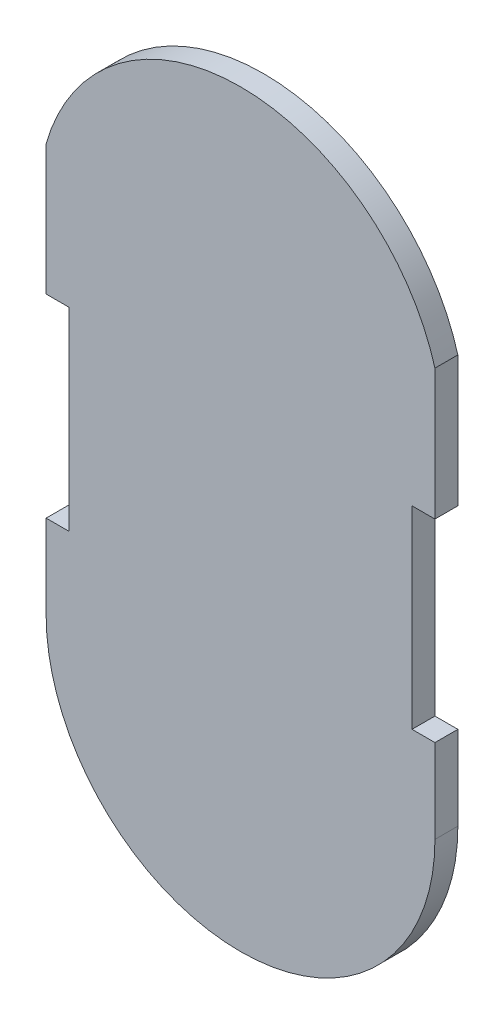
ISO-10303-21;
HEADER;
FILE_DESCRIPTION(('STEP AP214'),'2;1');
FILE_NAME('part.step','',(''),(''),'','','');
FILE_SCHEMA(('AUTOMOTIVE_DESIGN { 1 0 10303 214 1 1 1 1 }'));
ENDSEC;
DATA;
#1=APPLICATION_CONTEXT('core data for automotive mechanical design processes');
#2=APPLICATION_PROTOCOL_DEFINITION('international standard','automotive_design',2000,#1);
#3=PRODUCT_CONTEXT('',#1,'mechanical');
#4=PRODUCT('Part','Part','',(#3));
#5=PRODUCT_RELATED_PRODUCT_CATEGORY('part','',(#4));
#6=PRODUCT_DEFINITION_FORMATION('','',#4);
#7=PRODUCT_DEFINITION_CONTEXT('part definition',#1,'design');
#8=PRODUCT_DEFINITION('design','',#6,#7);
#9=PRODUCT_DEFINITION_SHAPE('','',#8);
#10=(LENGTH_UNIT() NAMED_UNIT(*) SI_UNIT(.MILLI.,.METRE.));
#11=(NAMED_UNIT(*) PLANE_ANGLE_UNIT() SI_UNIT($,.RADIAN.));
#12=(NAMED_UNIT(*) SI_UNIT($,.STERADIAN.) SOLID_ANGLE_UNIT());
#13=UNCERTAINTY_MEASURE_WITH_UNIT(LENGTH_MEASURE(1.E-05),#10,'distance_accuracy_value','');
#14=(GEOMETRIC_REPRESENTATION_CONTEXT(3) GLOBAL_UNCERTAINTY_ASSIGNED_CONTEXT((#13)) GLOBAL_UNIT_ASSIGNED_CONTEXT((#10,
#11,#12)) REPRESENTATION_CONTEXT('',''));
#15=CARTESIAN_POINT('',(0.,0.,0.));
#16=DIRECTION('',(0.,0.,1.));
#17=DIRECTION('',(1.,0.,0.));
#18=AXIS2_PLACEMENT_3D('',#15,#16,#17);
#19=CARTESIAN_POINT('',(26.0514524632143,-23.650430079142,1.524));
#20=DIRECTION('',(0.,1.,0.));
#21=DIRECTION('',(0.,0.,1.));
#22=AXIS2_PLACEMENT_3D('',#19,#20,#21);
#23=PLANE('',#22);
#24=DIRECTION('',(1.,0.,0.));
#25=VECTOR('',#24,1.);
#26=CARTESIAN_POINT('',(26.0514524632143,-23.650430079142,0.));
#27=LINE('',#26,#25);
#28=CARTESIAN_POINT('',(24.5274524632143,-23.650430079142,0.));
#29=VERTEX_POINT('',#28);
#30=CARTESIAN_POINT('',(26.0514524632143,-23.650430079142,0.));
#31=VERTEX_POINT('',#30);
#32=EDGE_CURVE('E152',#29,#31,#27,.T.);
#33=ORIENTED_EDGE('',*,*,#32,.T.);
#34=DIRECTION('',(0.,0.,-1.));
#35=VECTOR('',#34,1.);
#36=CARTESIAN_POINT('',(26.0514524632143,-23.650430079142,1.524));
#37=LINE('',#36,#35);
#38=CARTESIAN_POINT('',(26.0514524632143,-23.650430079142,1.524));
#39=VERTEX_POINT('',#38);
#40=EDGE_CURVE('E11',#39,#31,#37,.T.);
#41=ORIENTED_EDGE('',*,*,#40,.F.);
#42=DIRECTION('',(1.,0.,0.));
#43=VECTOR('',#42,1.);
#44=CARTESIAN_POINT('',(26.0514524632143,-23.650430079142,1.524));
#45=LINE('',#44,#43);
#46=CARTESIAN_POINT('',(24.5274524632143,-23.650430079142,1.524));
#47=VERTEX_POINT('',#46);
#48=EDGE_CURVE('E174',#47,#39,#45,.T.);
#49=ORIENTED_EDGE('',*,*,#48,.F.);
#50=DIRECTION('',(0.,0.,-1.));
#51=VECTOR('',#50,1.);
#52=CARTESIAN_POINT('',(24.5274524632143,-23.650430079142,1.524));
#53=LINE('',#52,#51);
#54=EDGE_CURVE('E148',#47,#29,#53,.T.);
#55=ORIENTED_EDGE('',*,*,#54,.T.);
#56=EDGE_LOOP('',(#33,#41,#49,#55));
#57=FACE_BOUND('',#56,.T.);
#58=ADVANCED_FACE('F32',(#57),#23,.F.);
#59=CARTESIAN_POINT('',(26.0514524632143,-14.9628014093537,1.524));
#60=DIRECTION('',(-1.,0.,0.));
#61=DIRECTION('',(0.,0.,1.));
#62=AXIS2_PLACEMENT_3D('',#59,#60,#61);
#63=PLANE('',#62);
#64=DIRECTION('',(0.,1.,0.));
#65=VECTOR('',#64,1.);
#66=CARTESIAN_POINT('',(26.0514524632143,-14.9628014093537,0.));
#67=LINE('',#66,#65);
#68=CARTESIAN_POINT('',(26.0514524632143,-14.9628014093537,0.));
#69=VERTEX_POINT('',#68);
#70=EDGE_CURVE('E155',#31,#69,#67,.T.);
#71=ORIENTED_EDGE('',*,*,#70,.T.);
#72=DIRECTION('',(0.,0.,-1.));
#73=VECTOR('',#72,1.);
#74=CARTESIAN_POINT('',(26.0514524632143,-14.9628014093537,1.524));
#75=LINE('',#74,#73);
#76=CARTESIAN_POINT('',(26.0514524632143,-14.9628014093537,1.524));
#77=VERTEX_POINT('',#76);
#78=EDGE_CURVE('E40',#77,#69,#75,.T.);
#79=ORIENTED_EDGE('',*,*,#78,.F.);
#80=DIRECTION('',(0.,1.,0.));
#81=VECTOR('',#80,1.);
#82=CARTESIAN_POINT('',(26.0514524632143,-14.9628014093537,1.524));
#83=LINE('',#82,#81);
#84=EDGE_CURVE('E103',#39,#77,#83,.T.);
#85=ORIENTED_EDGE('',*,*,#84,.F.);
#86=ORIENTED_EDGE('',*,*,#40,.T.);
#87=EDGE_LOOP('',(#71,#79,#85,#86));
#88=FACE_BOUND('',#87,.T.);
#89=ADVANCED_FACE('F252',(#88),#63,.F.);
#90=CARTESIAN_POINT('',(13.1287296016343,-18.6691696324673,1.524));
#91=DIRECTION('',(0.,0.,-1.));
#92=DIRECTION('',(-1.,0.,0.));
#93=AXIS2_PLACEMENT_3D('',#90,#91,#92);
#94=CYLINDRICAL_SURFACE('',#93,13.4437320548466);
#95=CARTESIAN_POINT('',(13.1287296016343,-18.6691696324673,0.));
#96=DIRECTION('',(0.,0.,1.));
#97=DIRECTION('',(-1.,0.,0.));
#98=AXIS2_PLACEMENT_3D('',#95,#96,#97);
#99=CIRCLE('',#98,13.4437320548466);
#100=CARTESIAN_POINT('',(0.206006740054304,-14.9628014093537,0.));
#101=VERTEX_POINT('',#100);
#102=EDGE_CURVE('E157',#69,#101,#99,.T.);
#103=ORIENTED_EDGE('',*,*,#102,.T.);
#104=DIRECTION('',(0.,0.,-1.));
#105=VECTOR('',#104,1.);
#106=CARTESIAN_POINT('',(0.206006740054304,-14.9628014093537,1.524));
#107=LINE('',#106,#105);
#108=CARTESIAN_POINT('',(0.206006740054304,-14.9628014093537,1.524));
#109=VERTEX_POINT('',#108);
#110=EDGE_CURVE('E193',#109,#101,#107,.T.);
#111=ORIENTED_EDGE('',*,*,#110,.F.);
#112=CARTESIAN_POINT('',(13.1287296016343,-18.6691696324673,1.524));
#113=DIRECTION('',(0.,0.,1.));
#114=DIRECTION('',(-1.,0.,0.));
#115=AXIS2_PLACEMENT_3D('',#112,#113,#114);
#116=CIRCLE('',#115,13.4437320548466);
#117=EDGE_CURVE('E201',#77,#109,#116,.T.);
#118=ORIENTED_EDGE('',*,*,#117,.F.);
#119=ORIENTED_EDGE('',*,*,#78,.T.);
#120=EDGE_LOOP('',(#103,#111,#118,#119));
#121=FACE_BOUND('',#120,.T.);
#122=ADVANCED_FACE('F199',(#121),#94,.T.);
#123=CARTESIAN_POINT('',(0.206006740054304,-14.9628014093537,1.524));
#124=DIRECTION('',(1.,0.,0.));
#125=DIRECTION('',(0.,1.,0.));
#126=AXIS2_PLACEMENT_3D('',#123,#124,#125);
#127=PLANE('',#126);
#128=DIRECTION('',(0.,-1.,0.));
#129=VECTOR('',#128,1.);
#130=CARTESIAN_POINT('',(0.206006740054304,-14.9628014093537,0.));
#131=LINE('',#130,#129);
#132=CARTESIAN_POINT('',(0.206006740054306,-23.6211874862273,0.));
#133=VERTEX_POINT('',#132);
#134=EDGE_CURVE('E159',#101,#133,#131,.T.);
#135=ORIENTED_EDGE('',*,*,#134,.T.);
#136=DIRECTION('',(0.,0.,-1.));
#137=VECTOR('',#136,1.);
#138=CARTESIAN_POINT('',(0.206006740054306,-23.6211874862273,1.524));
#139=LINE('',#138,#137);
#140=CARTESIAN_POINT('',(0.206006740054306,-23.6211874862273,1.524));
#141=VERTEX_POINT('',#140);
#142=EDGE_CURVE('E190',#141,#133,#139,.T.);
#143=ORIENTED_EDGE('',*,*,#142,.F.);
#144=DIRECTION('',(0.,-1.,0.));
#145=VECTOR('',#144,1.);
#146=CARTESIAN_POINT('',(0.206006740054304,-14.9628014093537,1.524));
#147=LINE('',#146,#145);
#148=EDGE_CURVE('E219',#109,#141,#147,.T.);
#149=ORIENTED_EDGE('',*,*,#148,.F.);
#150=ORIENTED_EDGE('',*,*,#110,.T.);
#151=EDGE_LOOP('',(#135,#143,#149,#150));
#152=FACE_BOUND('',#151,.T.);
#153=ADVANCED_FACE('F210',(#152),#127,.F.);
#154=CARTESIAN_POINT('',(1.72528777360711,-23.6211874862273,1.524));
#155=DIRECTION('',(0.,1.,0.));
#156=DIRECTION('',(0.,0.,1.));
#157=AXIS2_PLACEMENT_3D('',#154,#155,#156);
#158=PLANE('',#157);
#159=DIRECTION('',(1.,0.,0.));
#160=VECTOR('',#159,1.);
#161=CARTESIAN_POINT('',(1.72528777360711,-23.6211874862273,0.));
#162=LINE('',#161,#160);
#163=CARTESIAN_POINT('',(1.72528777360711,-23.6211874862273,0.));
#164=VERTEX_POINT('',#163);
#165=EDGE_CURVE('E161',#133,#164,#162,.T.);
#166=ORIENTED_EDGE('',*,*,#165,.T.);
#167=DIRECTION('',(0.,0.,-1.));
#168=VECTOR('',#167,1.);
#169=CARTESIAN_POINT('',(1.72528777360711,-23.6211874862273,1.524));
#170=LINE('',#169,#168);
#171=CARTESIAN_POINT('',(1.72528777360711,-23.6211874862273,1.524));
#172=VERTEX_POINT('',#171);
#173=EDGE_CURVE('E187',#172,#164,#170,.T.);
#174=ORIENTED_EDGE('',*,*,#173,.F.);
#175=DIRECTION('',(1.,0.,0.));
#176=VECTOR('',#175,1.);
#177=CARTESIAN_POINT('',(1.72528777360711,-23.6211874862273,1.524));
#178=LINE('',#177,#176);
#179=EDGE_CURVE('E216',#141,#172,#178,.T.);
#180=ORIENTED_EDGE('',*,*,#179,.F.);
#181=ORIENTED_EDGE('',*,*,#142,.T.);
#182=EDGE_LOOP('',(#166,#174,#180,#181));
#183=FACE_BOUND('',#182,.T.);
#184=ADVANCED_FACE('F214',(#183),#158,.F.);
#185=CARTESIAN_POINT('',(1.72528777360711,-36.5181421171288,1.524));
#186=DIRECTION('',(1.,0.,0.));
#187=DIRECTION('',(0.,0.,-1.));
#188=AXIS2_PLACEMENT_3D('',#185,#186,#187);
#189=PLANE('',#188);
#190=DIRECTION('',(0.,-1.,0.));
#191=VECTOR('',#190,1.);
#192=CARTESIAN_POINT('',(1.72528777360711,-36.5181421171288,0.));
#193=LINE('',#192,#191);
#194=CARTESIAN_POINT('',(1.72528777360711,-36.5181421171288,0.));
#195=VERTEX_POINT('',#194);
#196=EDGE_CURVE('E163',#164,#195,#193,.T.);
#197=ORIENTED_EDGE('',*,*,#196,.T.);
#198=DIRECTION('',(0.,0.,-1.));
#199=VECTOR('',#198,1.);
#200=CARTESIAN_POINT('',(1.72528777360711,-36.5181421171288,1.524));
#201=LINE('',#200,#199);
#202=CARTESIAN_POINT('',(1.72528777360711,-36.5181421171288,1.524));
#203=VERTEX_POINT('',#202);
#204=EDGE_CURVE('E184',#203,#195,#201,.T.);
#205=ORIENTED_EDGE('',*,*,#204,.F.);
#206=DIRECTION('',(0.,-1.,0.));
#207=VECTOR('',#206,1.);
#208=CARTESIAN_POINT('',(1.72528777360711,-36.5181421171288,1.524));
#209=LINE('',#208,#207);
#210=EDGE_CURVE('E218',#172,#203,#209,.T.);
#211=ORIENTED_EDGE('',*,*,#210,.F.);
#212=ORIENTED_EDGE('',*,*,#173,.T.);
#213=EDGE_LOOP('',(#197,#205,#211,#212));
#214=FACE_BOUND('',#213,.T.);
#215=ADVANCED_FACE('F265',(#214),#189,.F.);
#216=CARTESIAN_POINT('',(1.72528777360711,-36.5181421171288,1.524));
#217=DIRECTION('',(0.,-1.,0.));
#218=DIRECTION('',(0.,0.,-1.));
#219=AXIS2_PLACEMENT_3D('',#216,#217,#218);
#220=PLANE('',#219);
#221=DIRECTION('',(-1.,0.,0.));
#222=VECTOR('',#221,1.);
#223=CARTESIAN_POINT('',(1.72528777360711,-36.5181421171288,0.));
#224=LINE('',#223,#222);
#225=CARTESIAN_POINT('',(0.206006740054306,-36.5181421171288,0.));
#226=VERTEX_POINT('',#225);
#227=EDGE_CURVE('E165',#195,#226,#224,.T.);
#228=ORIENTED_EDGE('',*,*,#227,.T.);
#229=DIRECTION('',(0.,0.,-1.));
#230=VECTOR('',#229,1.);
#231=CARTESIAN_POINT('',(0.206006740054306,-36.5181421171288,1.524));
#232=LINE('',#231,#230);
#233=CARTESIAN_POINT('',(0.206006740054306,-36.5181421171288,1.524));
#234=VERTEX_POINT('',#233);
#235=EDGE_CURVE('E181',#234,#226,#232,.T.);
#236=ORIENTED_EDGE('',*,*,#235,.F.);
#237=DIRECTION('',(-1.,0.,0.));
#238=VECTOR('',#237,1.);
#239=CARTESIAN_POINT('',(1.72528777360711,-36.5181421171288,1.524));
#240=LINE('',#239,#238);
#241=EDGE_CURVE('E221',#203,#234,#240,.T.);
#242=ORIENTED_EDGE('',*,*,#241,.F.);
#243=ORIENTED_EDGE('',*,*,#204,.T.);
#244=EDGE_LOOP('',(#228,#236,#242,#243));
#245=FACE_BOUND('',#244,.T.);
#246=ADVANCED_FACE('F268',(#245),#220,.F.);
#247=CARTESIAN_POINT('',(0.206006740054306,-36.5181421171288,1.524));
#248=DIRECTION('',(1.,0.,0.));
#249=DIRECTION('',(0.,1.,0.));
#250=AXIS2_PLACEMENT_3D('',#247,#248,#249);
#251=PLANE('',#250);
#252=DIRECTION('',(0.,-1.,0.));
#253=VECTOR('',#252,1.);
#254=CARTESIAN_POINT('',(0.206006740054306,-36.5181421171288,0.));
#255=LINE('',#254,#253);
#256=CARTESIAN_POINT('',(0.206006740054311,-42.0900795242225,0.));
#257=VERTEX_POINT('',#256);
#258=EDGE_CURVE('E167',#226,#257,#255,.T.);
#259=ORIENTED_EDGE('',*,*,#258,.T.);
#260=DIRECTION('',(0.,0.,-1.));
#261=VECTOR('',#260,1.);
#262=CARTESIAN_POINT('',(0.206006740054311,-42.0900795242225,1.524));
#263=LINE('',#262,#261);
#264=CARTESIAN_POINT('',(0.206006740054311,-42.0900795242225,1.524));
#265=VERTEX_POINT('',#264);
#266=EDGE_CURVE('E178',#265,#257,#263,.T.);
#267=ORIENTED_EDGE('',*,*,#266,.F.);
#268=DIRECTION('',(0.,-1.,0.));
#269=VECTOR('',#268,1.);
#270=CARTESIAN_POINT('',(0.206006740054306,-36.5181421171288,1.524));
#271=LINE('',#270,#269);
#272=EDGE_CURVE('E227',#234,#265,#271,.T.);
#273=ORIENTED_EDGE('',*,*,#272,.F.);
#274=ORIENTED_EDGE('',*,*,#235,.T.);
#275=EDGE_LOOP('',(#259,#267,#273,#274));
#276=FACE_BOUND('',#275,.T.);
#277=ADVANCED_FACE('F233',(#276),#251,.F.);
#278=CARTESIAN_POINT('',(13.1287296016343,-42.0900795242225,1.524));
#279=DIRECTION('',(0.,0.,-1.));
#280=DIRECTION('',(-1.,0.,0.));
#281=AXIS2_PLACEMENT_3D('',#278,#279,#280);
#282=CYLINDRICAL_SURFACE('',#281,12.92272286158);
#283=CARTESIAN_POINT('',(13.1287296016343,-42.0900795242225,0.));
#284=DIRECTION('',(0.,0.,1.));
#285=DIRECTION('',(1.,0.,0.));
#286=AXIS2_PLACEMENT_3D('',#283,#284,#285);
#287=CIRCLE('',#286,12.92272286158);
#288=CARTESIAN_POINT('',(26.0514524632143,-42.0900795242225,0.));
#289=VERTEX_POINT('',#288);
#290=EDGE_CURVE('E169',#257,#289,#287,.T.);
#291=ORIENTED_EDGE('',*,*,#290,.T.);
#292=DIRECTION('',(0.,0.,-1.));
#293=VECTOR('',#292,1.);
#294=CARTESIAN_POINT('',(26.0514524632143,-42.0900795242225,1.524));
#295=LINE('',#294,#293);
#296=CARTESIAN_POINT('',(26.0514524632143,-42.0900795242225,1.524));
#297=VERTEX_POINT('',#296);
#298=EDGE_CURVE('E143',#297,#289,#295,.T.);
#299=ORIENTED_EDGE('',*,*,#298,.F.);
#300=CARTESIAN_POINT('',(13.1287296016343,-42.0900795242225,1.524));
#301=DIRECTION('',(0.,0.,1.));
#302=DIRECTION('',(1.,0.,0.));
#303=AXIS2_PLACEMENT_3D('',#300,#301,#302);
#304=CIRCLE('',#303,12.92272286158);
#305=EDGE_CURVE('E134',#265,#297,#304,.T.);
#306=ORIENTED_EDGE('',*,*,#305,.F.);
#307=ORIENTED_EDGE('',*,*,#266,.T.);
#308=EDGE_LOOP('',(#291,#299,#306,#307));
#309=FACE_BOUND('',#308,.T.);
#310=ADVANCED_FACE('F237',(#309),#282,.T.);
#311=CARTESIAN_POINT('',(26.0514524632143,-36.5153857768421,1.524));
#312=DIRECTION('',(-1.,0.,0.));
#313=DIRECTION('',(0.,0.,1.));
#314=AXIS2_PLACEMENT_3D('',#311,#312,#313);
#315=PLANE('',#314);
#316=DIRECTION('',(0.,1.,0.));
#317=VECTOR('',#316,1.);
#318=CARTESIAN_POINT('',(26.0514524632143,-36.5153857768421,0.));
#319=LINE('',#318,#317);
#320=CARTESIAN_POINT('',(26.0514524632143,-36.5153857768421,0.));
#321=VERTEX_POINT('',#320);
#322=EDGE_CURVE('E142',#289,#321,#319,.T.);
#323=ORIENTED_EDGE('',*,*,#322,.T.);
#324=DIRECTION('',(0.,0.,-1.));
#325=VECTOR('',#324,1.);
#326=CARTESIAN_POINT('',(26.0514524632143,-36.5153857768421,1.524));
#327=LINE('',#326,#325);
#328=CARTESIAN_POINT('',(26.0514524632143,-36.5153857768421,1.524));
#329=VERTEX_POINT('',#328);
#330=EDGE_CURVE('E139',#329,#321,#327,.T.);
#331=ORIENTED_EDGE('',*,*,#330,.F.);
#332=DIRECTION('',(0.,1.,0.));
#333=VECTOR('',#332,1.);
#334=CARTESIAN_POINT('',(26.0514524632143,-36.5153857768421,1.524));
#335=LINE('',#334,#333);
#336=EDGE_CURVE('E128',#297,#329,#335,.T.);
#337=ORIENTED_EDGE('',*,*,#336,.F.);
#338=ORIENTED_EDGE('',*,*,#298,.T.);
#339=EDGE_LOOP('',(#323,#331,#337,#338));
#340=FACE_BOUND('',#339,.T.);
#341=ADVANCED_FACE('F140',(#340),#315,.F.);
#342=CARTESIAN_POINT('',(26.0514524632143,-36.5153857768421,1.524));
#343=DIRECTION('',(0.,-1.,0.));
#344=DIRECTION('',(0.,0.,-1.));
#345=AXIS2_PLACEMENT_3D('',#342,#343,#344);
#346=PLANE('',#345);
#347=DIRECTION('',(-1.,0.,0.));
#348=VECTOR('',#347,1.);
#349=CARTESIAN_POINT('',(26.0514524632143,-36.5153857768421,0.));
#350=LINE('',#349,#348);
#351=CARTESIAN_POINT('',(24.5274524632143,-36.5153857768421,0.));
#352=VERTEX_POINT('',#351);
#353=EDGE_CURVE('E89',#321,#352,#350,.T.);
#354=ORIENTED_EDGE('',*,*,#353,.T.);
#355=DIRECTION('',(0.,0.,-1.));
#356=VECTOR('',#355,1.);
#357=CARTESIAN_POINT('',(24.5274524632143,-36.5153857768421,1.524));
#358=LINE('',#357,#356);
#359=CARTESIAN_POINT('',(24.5274524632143,-36.5153857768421,1.524));
#360=VERTEX_POINT('',#359);
#361=EDGE_CURVE('E144',#360,#352,#358,.T.);
#362=ORIENTED_EDGE('',*,*,#361,.F.);
#363=DIRECTION('',(-1.,0.,0.));
#364=VECTOR('',#363,1.);
#365=CARTESIAN_POINT('',(26.0514524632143,-36.5153857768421,1.524));
#366=LINE('',#365,#364);
#367=EDGE_CURVE('E132',#329,#360,#366,.T.);
#368=ORIENTED_EDGE('',*,*,#367,.F.);
#369=ORIENTED_EDGE('',*,*,#330,.T.);
#370=EDGE_LOOP('',(#354,#362,#368,#369));
#371=FACE_BOUND('',#370,.T.);
#372=ADVANCED_FACE('F146',(#371),#346,.F.);
#373=CARTESIAN_POINT('',(24.5274524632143,-23.650430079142,1.524));
#374=DIRECTION('',(-1.,0.,0.));
#375=DIRECTION('',(0.,0.,1.));
#376=AXIS2_PLACEMENT_3D('',#373,#374,#375);
#377=PLANE('',#376);
#378=DIRECTION('',(0.,1.,0.));
#379=VECTOR('',#378,1.);
#380=CARTESIAN_POINT('',(24.5274524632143,-23.650430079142,0.));
#381=LINE('',#380,#379);
#382=EDGE_CURVE('E95',#352,#29,#381,.T.);
#383=ORIENTED_EDGE('',*,*,#382,.T.);
#384=ORIENTED_EDGE('',*,*,#54,.F.);
#385=DIRECTION('',(0.,1.,0.));
#386=VECTOR('',#385,1.);
#387=CARTESIAN_POINT('',(24.5274524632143,-23.650430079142,1.524));
#388=LINE('',#387,#386);
#389=EDGE_CURVE('E48',#360,#47,#388,.T.);
#390=ORIENTED_EDGE('',*,*,#389,.F.);
#391=ORIENTED_EDGE('',*,*,#361,.T.);
#392=EDGE_LOOP('',(#383,#384,#390,#391));
#393=FACE_BOUND('',#392,.T.);
#394=ADVANCED_FACE('F241',(#393),#377,.F.);
#395=CARTESIAN_POINT('',(13.1287296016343,-42.0900795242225,1.524));
#396=DIRECTION('',(0.,0.,1.));
#397=DIRECTION('',(1.,0.,0.));
#398=AXIS2_PLACEMENT_3D('',#395,#396,#397);
#399=PLANE('',#398);
#400=ORIENTED_EDGE('',*,*,#48,.T.);
#401=ORIENTED_EDGE('',*,*,#84,.T.);
#402=ORIENTED_EDGE('',*,*,#117,.T.);
#403=ORIENTED_EDGE('',*,*,#148,.T.);
#404=ORIENTED_EDGE('',*,*,#179,.T.);
#405=ORIENTED_EDGE('',*,*,#210,.T.);
#406=ORIENTED_EDGE('',*,*,#241,.T.);
#407=ORIENTED_EDGE('',*,*,#272,.T.);
#408=ORIENTED_EDGE('',*,*,#305,.T.);
#409=ORIENTED_EDGE('',*,*,#336,.T.);
#410=ORIENTED_EDGE('',*,*,#367,.T.);
#411=ORIENTED_EDGE('',*,*,#389,.T.);
#412=EDGE_LOOP('',(#400,#401,#402,#403,#404,#405,#406,#407,#408,#409,#410,#411));
#413=FACE_BOUND('',#412,.T.);
#414=ADVANCED_FACE('F130',(#413),#399,.T.);
#415=CARTESIAN_POINT('',(13.1287296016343,-42.0900795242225,0.));
#416=DIRECTION('',(0.,0.,1.));
#417=DIRECTION('',(1.,0.,0.));
#418=AXIS2_PLACEMENT_3D('',#415,#416,#417);
#419=PLANE('',#418);
#420=ORIENTED_EDGE('',*,*,#32,.F.);
#421=ORIENTED_EDGE('',*,*,#382,.F.);
#422=ORIENTED_EDGE('',*,*,#353,.F.);
#423=ORIENTED_EDGE('',*,*,#322,.F.);
#424=ORIENTED_EDGE('',*,*,#290,.F.);
#425=ORIENTED_EDGE('',*,*,#258,.F.);
#426=ORIENTED_EDGE('',*,*,#227,.F.);
#427=ORIENTED_EDGE('',*,*,#196,.F.);
#428=ORIENTED_EDGE('',*,*,#165,.F.);
#429=ORIENTED_EDGE('',*,*,#134,.F.);
#430=ORIENTED_EDGE('',*,*,#102,.F.);
#431=ORIENTED_EDGE('',*,*,#70,.F.);
#432=EDGE_LOOP('',(#420,#421,#422,#423,#424,#425,#426,#427,#428,#429,#430,#431));
#433=FACE_BOUND('',#432,.T.);
#434=ADVANCED_FACE('F205',(#433),#419,.F.);
#435=CLOSED_SHELL('',(#58,#89,#122,#153,#184,#215,#246,#277,#310,#341,#372,#394,#414,#434));
#436=MANIFOLD_SOLID_BREP('B2',#435);
#437=ADVANCED_BREP_SHAPE_REPRESENTATION('',(#18,#436),#14);
#438=SHAPE_DEFINITION_REPRESENTATION(#9,#437);
ENDSEC;
END-ISO-10303-21;
